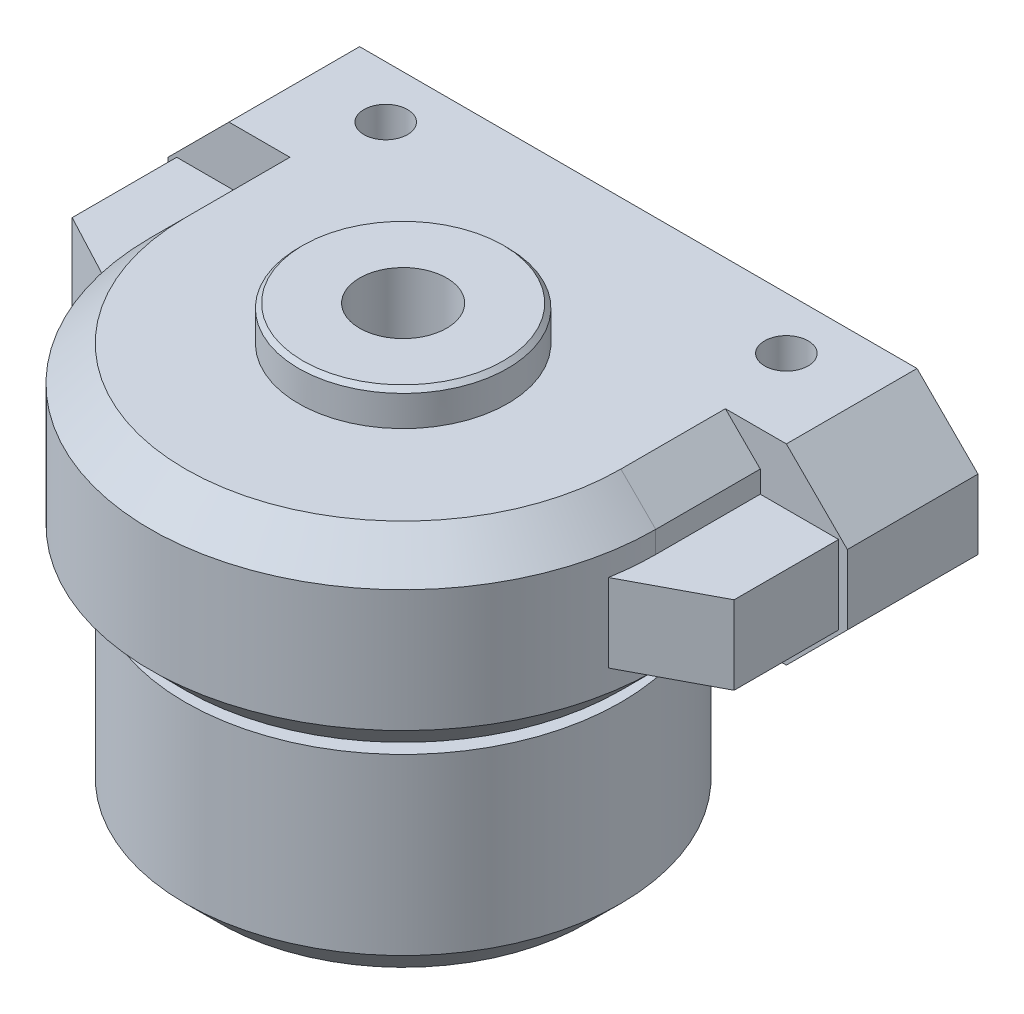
ISO-10303-21;
HEADER;
FILE_DESCRIPTION(('STEP AP214'),'2;1');
FILE_NAME('part.step','',(''),(''),'','','');
FILE_SCHEMA(('AUTOMOTIVE_DESIGN { 1 0 10303 214 1 1 1 1 }'));
ENDSEC;
DATA;
#1=APPLICATION_CONTEXT('core data for automotive mechanical design processes');
#2=APPLICATION_PROTOCOL_DEFINITION('international standard','automotive_design',2000,#1);
#3=PRODUCT_CONTEXT('',#1,'mechanical');
#4=PRODUCT('Part','Part','',(#3));
#5=PRODUCT_RELATED_PRODUCT_CATEGORY('part','',(#4));
#6=PRODUCT_DEFINITION_FORMATION('','',#4);
#7=PRODUCT_DEFINITION_CONTEXT('part definition',#1,'design');
#8=PRODUCT_DEFINITION('design','',#6,#7);
#9=PRODUCT_DEFINITION_SHAPE('','',#8);
#10=(LENGTH_UNIT() NAMED_UNIT(*) SI_UNIT(.MILLI.,.METRE.));
#11=(NAMED_UNIT(*) PLANE_ANGLE_UNIT() SI_UNIT($,.RADIAN.));
#12=(NAMED_UNIT(*) SI_UNIT($,.STERADIAN.) SOLID_ANGLE_UNIT());
#13=UNCERTAINTY_MEASURE_WITH_UNIT(LENGTH_MEASURE(1.E-05),#10,'distance_accuracy_value','');
#14=(GEOMETRIC_REPRESENTATION_CONTEXT(3) GLOBAL_UNCERTAINTY_ASSIGNED_CONTEXT((#13)) GLOBAL_UNIT_ASSIGNED_CONTEXT((#10,
#11,#12)) REPRESENTATION_CONTEXT('',''));
#15=CARTESIAN_POINT('',(0.,0.,0.));
#16=DIRECTION('',(0.,0.,1.));
#17=DIRECTION('',(1.,0.,0.));
#18=AXIS2_PLACEMENT_3D('',#15,#16,#17);
#19=CARTESIAN_POINT('',(0.,22.,15.));
#20=DIRECTION('',(0.,-1.,0.));
#21=DIRECTION('',(0.,0.,-1.));
#22=AXIS2_PLACEMENT_3D('',#19,#20,#21);
#23=PLANE('',#22);
#24=CARTESIAN_POINT('',(16.,22.,6.));
#25=DIRECTION('',(0.,1.,0.));
#26=DIRECTION('',(0.,0.,-1.));
#27=AXIS2_PLACEMENT_3D('',#24,#25,#26);
#28=CIRCLE('',#27,2.5);
#29=CARTESIAN_POINT('',(16.,22.,3.5));
#30=VERTEX_POINT('',#29);
#31=EDGE_CURVE('E346',#30,#30,#28,.T.);
#32=ORIENTED_EDGE('',*,*,#31,.F.);
#33=EDGE_LOOP('',(#32));
#34=FACE_BOUND('',#33,.T.);
#35=CARTESIAN_POINT('',(62.,22.,6.));
#36=DIRECTION('',(0.,1.,0.));
#37=DIRECTION('',(0.,0.,1.));
#38=AXIS2_PLACEMENT_3D('',#35,#36,#37);
#39=CIRCLE('',#38,2.5);
#40=CARTESIAN_POINT('',(62.,22.,8.5));
#41=VERTEX_POINT('',#40);
#42=EDGE_CURVE('E336',#41,#41,#39,.T.);
#43=ORIENTED_EDGE('',*,*,#42,.F.);
#44=EDGE_LOOP('',(#43));
#45=FACE_BOUND('',#44,.T.);
#46=DIRECTION('',(-1.,0.,0.));
#47=VECTOR('',#46,1.);
#48=CARTESIAN_POINT('',(0.,22.,15.));
#49=LINE('',#48,#47);
#50=CARTESIAN_POINT('',(71.,22.,15.));
#51=VERTEX_POINT('',#50);
#52=CARTESIAN_POINT('',(64.,22.,15.));
#53=VERTEX_POINT('',#52);
#54=EDGE_CURVE('E416',#51,#53,#49,.T.);
#55=ORIENTED_EDGE('',*,*,#54,.F.);
#56=DIRECTION('',(0.,0.,-1.));
#57=VECTOR('',#56,1.);
#58=CARTESIAN_POINT('',(71.,22.,15.));
#59=LINE('',#58,#57);
#60=CARTESIAN_POINT('',(71.,22.,0.));
#61=VERTEX_POINT('',#60);
#62=EDGE_CURVE('E513',#51,#61,#59,.T.);
#63=ORIENTED_EDGE('',*,*,#62,.T.);
#64=DIRECTION('',(-1.,0.,0.));
#65=VECTOR('',#64,1.);
#66=CARTESIAN_POINT('',(0.,22.,0.));
#67=LINE('',#66,#65);
#68=CARTESIAN_POINT('',(7.00000000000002,22.,0.));
#69=VERTEX_POINT('',#68);
#70=EDGE_CURVE('E547',#61,#69,#67,.T.);
#71=ORIENTED_EDGE('',*,*,#70,.T.);
#72=DIRECTION('',(0.,0.,1.));
#73=VECTOR('',#72,1.);
#74=CARTESIAN_POINT('',(7.00000000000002,22.,15.));
#75=LINE('',#74,#73);
#76=CARTESIAN_POINT('',(7.00000000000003,22.,15.));
#77=VERTEX_POINT('',#76);
#78=EDGE_CURVE('E511',#69,#77,#75,.T.);
#79=ORIENTED_EDGE('',*,*,#78,.T.);
#80=CARTESIAN_POINT('',(14.,22.,15.));
#81=VERTEX_POINT('',#80);
#82=EDGE_CURVE('E421',#81,#77,#49,.T.);
#83=ORIENTED_EDGE('',*,*,#82,.F.);
#84=DIRECTION('',(0.,0.,1.));
#85=VECTOR('',#84,1.);
#86=CARTESIAN_POINT('',(14.,22.,27.));
#87=LINE('',#86,#85);
#88=CARTESIAN_POINT('',(14.,22.,27.));
#89=VERTEX_POINT('',#88);
#90=EDGE_CURVE('E456',#81,#89,#87,.T.);
#91=ORIENTED_EDGE('',*,*,#90,.T.);
#92=CARTESIAN_POINT('',(39.,22.,27.));
#93=DIRECTION('',(0.,-1.,0.));
#94=DIRECTION('',(0.,0.,-1.));
#95=AXIS2_PLACEMENT_3D('',#92,#93,#94);
#96=CIRCLE('',#95,25.);
#97=CARTESIAN_POINT('',(64.,22.,27.));
#98=VERTEX_POINT('',#97);
#99=EDGE_CURVE('E460',#89,#98,#96,.F.);
#100=ORIENTED_EDGE('',*,*,#99,.T.);
#101=DIRECTION('',(0.,0.,-1.));
#102=VECTOR('',#101,1.);
#103=CARTESIAN_POINT('',(64.,22.,15.));
#104=LINE('',#103,#102);
#105=EDGE_CURVE('E462',#98,#53,#104,.T.);
#106=ORIENTED_EDGE('',*,*,#105,.T.);
#107=EDGE_LOOP('',(#55,#63,#71,#79,#83,#91,#100,#106));
#108=FACE_BOUND('',#107,.T.);
#109=CARTESIAN_POINT('',(39.,22.,27.));
#110=DIRECTION('',(0.,-1.,0.));
#111=DIRECTION('',(0.,0.,-1.));
#112=AXIS2_PLACEMENT_3D('',#109,#110,#111);
#113=CIRCLE('',#112,12.);
#114=CARTESIAN_POINT('',(39.,22.,15.));
#115=VERTEX_POINT('',#114);
#116=EDGE_CURVE('E328',#115,#115,#113,.F.);
#117=ORIENTED_EDGE('',*,*,#116,.F.);
#118=EDGE_LOOP('',(#117));
#119=FACE_BOUND('',#118,.T.);
#120=ADVANCED_FACE('F24',(#34,#45,#108,#119),#23,.F.);
#121=CARTESIAN_POINT('',(0.,22.,15.));
#122=DIRECTION('',(0.,0.,-1.));
#123=DIRECTION('',(-1.,0.,0.));
#124=AXIS2_PLACEMENT_3D('',#121,#122,#123);
#125=PLANE('',#124);
#126=DIRECTION('',(-1.,0.,0.));
#127=VECTOR('',#126,1.);
#128=CARTESIAN_POINT('',(1.,15.5,15.));
#129=LINE('',#128,#127);
#130=CARTESIAN_POINT('',(10.,15.5,15.));
#131=VERTEX_POINT('',#130);
#132=CARTESIAN_POINT('',(1.,15.5,15.));
#133=VERTEX_POINT('',#132);
#134=EDGE_CURVE('E238',#131,#133,#129,.T.);
#135=ORIENTED_EDGE('',*,*,#134,.F.);
#136=DIRECTION('',(0.,1.,0.));
#137=VECTOR('',#136,1.);
#138=CARTESIAN_POINT('',(10.,0.,15.));
#139=LINE('',#138,#137);
#140=CARTESIAN_POINT('',(10.,18.,15.));
#141=VERTEX_POINT('',#140);
#142=EDGE_CURVE('E322',#131,#141,#139,.T.);
#143=ORIENTED_EDGE('',*,*,#142,.T.);
#144=DIRECTION('',(0.707106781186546,0.707106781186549,0.));
#145=VECTOR('',#144,1.);
#146=CARTESIAN_POINT('',(7.00000000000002,15.,15.));
#147=LINE('',#146,#145);
#148=EDGE_CURVE('E473',#141,#81,#147,.T.);
#149=ORIENTED_EDGE('',*,*,#148,.T.);
#150=ORIENTED_EDGE('',*,*,#82,.T.);
#151=DIRECTION('',(0.707106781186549,0.707106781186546,0.));
#152=VECTOR('',#151,1.);
#153=CARTESIAN_POINT('',(0.,15.,15.));
#154=LINE('',#153,#152);
#155=CARTESIAN_POINT('',(0.,15.,15.));
#156=VERTEX_POINT('',#155);
#157=EDGE_CURVE('E521',#77,#156,#154,.F.);
#158=ORIENTED_EDGE('',*,*,#157,.T.);
#159=DIRECTION('',(0.,-1.,0.));
#160=VECTOR('',#159,1.);
#161=CARTESIAN_POINT('',(0.,0.,15.));
#162=LINE('',#161,#160);
#163=CARTESIAN_POINT('',(0.,7.00000000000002,15.));
#164=VERTEX_POINT('',#163);
#165=EDGE_CURVE('E499',#156,#164,#162,.T.);
#166=ORIENTED_EDGE('',*,*,#165,.T.);
#167=DIRECTION('',(-0.707106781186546,0.707106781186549,0.));
#168=VECTOR('',#167,1.);
#169=CARTESIAN_POINT('',(7.,0.,15.));
#170=LINE('',#169,#168);
#171=CARTESIAN_POINT('',(7.,0.,15.));
#172=VERTEX_POINT('',#171);
#173=EDGE_CURVE('E331',#164,#172,#170,.F.);
#174=ORIENTED_EDGE('',*,*,#173,.T.);
#175=DIRECTION('',(1.,0.,0.));
#176=VECTOR('',#175,1.);
#177=CARTESIAN_POINT('',(0.,0.,15.));
#178=LINE('',#177,#176);
#179=CARTESIAN_POINT('',(14.,0.,15.));
#180=VERTEX_POINT('',#179);
#181=EDGE_CURVE('E490',#172,#180,#178,.T.);
#182=ORIENTED_EDGE('',*,*,#181,.T.);
#183=DIRECTION('',(-0.707106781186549,0.707106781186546,0.));
#184=VECTOR('',#183,1.);
#185=CARTESIAN_POINT('',(-4.00000000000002,18.,15.));
#186=LINE('',#185,#184);
#187=CARTESIAN_POINT('',(10.,4.,15.));
#188=VERTEX_POINT('',#187);
#189=EDGE_CURVE('E468',#180,#188,#186,.T.);
#190=ORIENTED_EDGE('',*,*,#189,.T.);
#191=CARTESIAN_POINT('',(10.,6.5,15.));
#192=VERTEX_POINT('',#191);
#193=EDGE_CURVE('E318',#188,#192,#139,.T.);
#194=ORIENTED_EDGE('',*,*,#193,.T.);
#195=DIRECTION('',(-1.,0.,0.));
#196=VECTOR('',#195,1.);
#197=CARTESIAN_POINT('',(1.,6.5,15.));
#198=LINE('',#197,#196);
#199=CARTESIAN_POINT('',(1.,6.5,15.));
#200=VERTEX_POINT('',#199);
#201=EDGE_CURVE('E46',#192,#200,#198,.T.);
#202=ORIENTED_EDGE('',*,*,#201,.T.);
#203=DIRECTION('',(0.,-1.,0.));
#204=VECTOR('',#203,1.);
#205=CARTESIAN_POINT('',(1.,15.5,15.));
#206=LINE('',#205,#204);
#207=EDGE_CURVE('E41',#133,#200,#206,.T.);
#208=ORIENTED_EDGE('',*,*,#207,.F.);
#209=EDGE_LOOP('',(#135,#143,#149,#150,#158,#166,#174,#182,#190,#194,#202,#208));
#210=FACE_BOUND('',#209,.T.);
#211=ADVANCED_FACE('F374',(#210),#125,.F.);
#212=CARTESIAN_POINT('',(39.,0.,27.));
#213=DIRECTION('',(0.,1.,0.));
#214=DIRECTION('',(0.,0.,1.));
#215=AXIS2_PLACEMENT_3D('',#212,#213,#214);
#216=CYLINDRICAL_SURFACE('',#215,29.);
#217=DIRECTION('',(0.,1.,0.));
#218=VECTOR('',#217,1.);
#219=CARTESIAN_POINT('',(10.,0.,27.));
#220=LINE('',#219,#218);
#221=CARTESIAN_POINT('',(10.,15.5,27.));
#222=VERTEX_POINT('',#221);
#223=CARTESIAN_POINT('',(10.,18.,27.));
#224=VERTEX_POINT('',#223);
#225=EDGE_CURVE('E208',#222,#224,#220,.T.);
#226=ORIENTED_EDGE('',*,*,#225,.F.);
#227=CARTESIAN_POINT('',(39.,15.5,27.));
#228=DIRECTION('',(0.,-1.,0.));
#229=DIRECTION('',(0.,0.,-1.));
#230=AXIS2_PLACEMENT_3D('',#227,#228,#229);
#231=CIRCLE('',#230,29.);
#232=CARTESIAN_POINT('',(10.4342862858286,15.5,32.));
#233=VERTEX_POINT('',#232);
#234=EDGE_CURVE('E232',#233,#222,#231,.T.);
#235=ORIENTED_EDGE('',*,*,#234,.F.);
#236=DIRECTION('',(0.,-1.,0.));
#237=VECTOR('',#236,1.);
#238=CARTESIAN_POINT('',(10.4342862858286,15.5,32.));
#239=LINE('',#238,#237);
#240=CARTESIAN_POINT('',(10.4342862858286,6.5,32.));
#241=VERTEX_POINT('',#240);
#242=EDGE_CURVE('E215',#233,#241,#239,.T.);
#243=ORIENTED_EDGE('',*,*,#242,.T.);
#244=CARTESIAN_POINT('',(39.,6.5,27.));
#245=DIRECTION('',(0.,-1.,0.));
#246=DIRECTION('',(0.,0.,-1.));
#247=AXIS2_PLACEMENT_3D('',#244,#245,#246);
#248=CIRCLE('',#247,29.);
#249=CARTESIAN_POINT('',(10.,6.5,27.));
#250=VERTEX_POINT('',#249);
#251=EDGE_CURVE('E211',#241,#250,#248,.T.);
#252=ORIENTED_EDGE('',*,*,#251,.T.);
#253=CARTESIAN_POINT('',(10.,4.,27.));
#254=VERTEX_POINT('',#253);
#255=EDGE_CURVE('E197',#254,#250,#220,.T.);
#256=ORIENTED_EDGE('',*,*,#255,.F.);
#257=CARTESIAN_POINT('',(39.,4.,27.));
#258=DIRECTION('',(0.,1.,0.));
#259=DIRECTION('',(0.,0.,1.));
#260=AXIS2_PLACEMENT_3D('',#257,#258,#259);
#261=CIRCLE('',#260,29.);
#262=CARTESIAN_POINT('',(68.,4.,27.));
#263=VERTEX_POINT('',#262);
#264=EDGE_CURVE('E446',#254,#263,#261,.T.);
#265=ORIENTED_EDGE('',*,*,#264,.T.);
#266=DIRECTION('',(0.,1.,0.));
#267=VECTOR('',#266,1.);
#268=CARTESIAN_POINT('',(68.,0.,27.));
#269=LINE('',#268,#267);
#270=CARTESIAN_POINT('',(68.,6.5,27.));
#271=VERTEX_POINT('',#270);
#272=EDGE_CURVE('E553',#263,#271,#269,.T.);
#273=ORIENTED_EDGE('',*,*,#272,.T.);
#274=CARTESIAN_POINT('',(39.,6.5,27.));
#275=DIRECTION('',(0.,-1.,0.));
#276=DIRECTION('',(0.,0.,1.));
#277=AXIS2_PLACEMENT_3D('',#274,#275,#276);
#278=CIRCLE('',#277,29.);
#279=CARTESIAN_POINT('',(67.5657137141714,6.5,32.));
#280=VERTEX_POINT('',#279);
#281=EDGE_CURVE('E255',#271,#280,#278,.T.);
#282=ORIENTED_EDGE('',*,*,#281,.T.);
#283=DIRECTION('',(0.,-1.,0.));
#284=VECTOR('',#283,1.);
#285=CARTESIAN_POINT('',(67.5657137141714,15.5,32.));
#286=LINE('',#285,#284);
#287=CARTESIAN_POINT('',(67.5657137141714,15.5,32.));
#288=VERTEX_POINT('',#287);
#289=EDGE_CURVE('E279',#288,#280,#286,.T.);
#290=ORIENTED_EDGE('',*,*,#289,.F.);
#291=CARTESIAN_POINT('',(39.,15.5,27.));
#292=DIRECTION('',(0.,-1.,0.));
#293=DIRECTION('',(0.,0.,1.));
#294=AXIS2_PLACEMENT_3D('',#291,#292,#293);
#295=CIRCLE('',#294,29.);
#296=CARTESIAN_POINT('',(68.,15.5,27.));
#297=VERTEX_POINT('',#296);
#298=EDGE_CURVE('E268',#297,#288,#295,.T.);
#299=ORIENTED_EDGE('',*,*,#298,.F.);
#300=CARTESIAN_POINT('',(68.,18.,27.));
#301=VERTEX_POINT('',#300);
#302=EDGE_CURVE('E310',#297,#301,#269,.T.);
#303=ORIENTED_EDGE('',*,*,#302,.T.);
#304=CARTESIAN_POINT('',(39.,18.,27.));
#305=DIRECTION('',(0.,-1.,0.));
#306=DIRECTION('',(0.,0.,-1.));
#307=AXIS2_PLACEMENT_3D('',#304,#305,#306);
#308=CIRCLE('',#307,29.);
#309=EDGE_CURVE('E444',#301,#224,#308,.T.);
#310=ORIENTED_EDGE('',*,*,#309,.T.);
#311=EDGE_LOOP('',(#226,#235,#243,#252,#256,#265,#273,#282,#290,#299,#303,#310));
#312=FACE_BOUND('',#311,.T.);
#313=ADVANCED_FACE('F213',(#312),#216,.T.);
#314=CARTESIAN_POINT('',(10.,0.,15.));
#315=DIRECTION('',(-1.,0.,0.));
#316=DIRECTION('',(0.,0.,1.));
#317=AXIS2_PLACEMENT_3D('',#314,#315,#316);
#318=PLANE('',#317);
#319=ORIENTED_EDGE('',*,*,#142,.F.);
#320=DIRECTION('',(0.,0.,-1.));
#321=VECTOR('',#320,1.);
#322=CARTESIAN_POINT('',(9.99999999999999,15.5,15.));
#323=LINE('',#322,#321);
#324=EDGE_CURVE('E235',#222,#131,#323,.T.);
#325=ORIENTED_EDGE('',*,*,#324,.F.);
#326=ORIENTED_EDGE('',*,*,#225,.T.);
#327=DIRECTION('',(0.,0.,-1.));
#328=VECTOR('',#327,1.);
#329=CARTESIAN_POINT('',(10.,18.,15.));
#330=LINE('',#329,#328);
#331=EDGE_CURVE('E447',#224,#141,#330,.T.);
#332=ORIENTED_EDGE('',*,*,#331,.T.);
#333=EDGE_LOOP('',(#319,#325,#326,#332));
#334=FACE_BOUND('',#333,.T.);
#335=ADVANCED_FACE('F399',(#334),#318,.T.);
#336=CARTESIAN_POINT('',(68.,0.,15.));
#337=DIRECTION('',(1.,0.,0.));
#338=DIRECTION('',(0.,0.,-1.));
#339=AXIS2_PLACEMENT_3D('',#336,#337,#338);
#340=PLANE('',#339);
#341=DIRECTION('',(0.,1.,0.));
#342=VECTOR('',#341,1.);
#343=CARTESIAN_POINT('',(68.,0.,15.));
#344=LINE('',#343,#342);
#345=CARTESIAN_POINT('',(68.,4.,15.));
#346=VERTEX_POINT('',#345);
#347=CARTESIAN_POINT('',(68.,6.5,15.));
#348=VERTEX_POINT('',#347);
#349=EDGE_CURVE('E325',#346,#348,#344,.T.);
#350=ORIENTED_EDGE('',*,*,#349,.T.);
#351=DIRECTION('',(0.,0.,1.));
#352=VECTOR('',#351,1.);
#353=CARTESIAN_POINT('',(68.,6.5,15.));
#354=LINE('',#353,#352);
#355=EDGE_CURVE('E252',#348,#271,#354,.T.);
#356=ORIENTED_EDGE('',*,*,#355,.T.);
#357=ORIENTED_EDGE('',*,*,#272,.F.);
#358=DIRECTION('',(0.,0.,-1.));
#359=VECTOR('',#358,1.);
#360=CARTESIAN_POINT('',(68.,4.,15.));
#361=LINE('',#360,#359);
#362=EDGE_CURVE('E434',#263,#346,#361,.T.);
#363=ORIENTED_EDGE('',*,*,#362,.T.);
#364=EDGE_LOOP('',(#350,#356,#357,#363));
#365=FACE_BOUND('',#364,.T.);
#366=ADVANCED_FACE('F392',(#365),#340,.T.);
#367=CARTESIAN_POINT('',(0.,0.,15.));
#368=DIRECTION('',(0.,1.,0.));
#369=DIRECTION('',(0.,0.,1.));
#370=AXIS2_PLACEMENT_3D('',#367,#368,#369);
#371=PLANE('',#370);
#372=CARTESIAN_POINT('',(16.,0.,6.));
#373=DIRECTION('',(0.,1.,0.));
#374=DIRECTION('',(0.,0.,1.));
#375=AXIS2_PLACEMENT_3D('',#372,#373,#374);
#376=CIRCLE('',#375,2.5);
#377=CARTESIAN_POINT('',(16.,0.,8.5));
#378=VERTEX_POINT('',#377);
#379=EDGE_CURVE('E28',#378,#378,#376,.T.);
#380=ORIENTED_EDGE('',*,*,#379,.T.);
#381=EDGE_LOOP('',(#380));
#382=FACE_BOUND('',#381,.T.);
#383=CARTESIAN_POINT('',(62.,0.,6.));
#384=DIRECTION('',(0.,1.,0.));
#385=DIRECTION('',(0.,0.,1.));
#386=AXIS2_PLACEMENT_3D('',#383,#384,#385);
#387=CIRCLE('',#386,2.5);
#388=CARTESIAN_POINT('',(62.,0.,8.5));
#389=VERTEX_POINT('',#388);
#390=EDGE_CURVE('E333',#389,#389,#387,.T.);
#391=ORIENTED_EDGE('',*,*,#390,.T.);
#392=EDGE_LOOP('',(#391));
#393=FACE_BOUND('',#392,.T.);
#394=DIRECTION('',(1.,0.,0.));
#395=VECTOR('',#394,1.);
#396=CARTESIAN_POINT('',(0.,0.,0.));
#397=LINE('',#396,#395);
#398=CARTESIAN_POINT('',(7.,0.,0.));
#399=VERTEX_POINT('',#398);
#400=CARTESIAN_POINT('',(71.,0.,0.));
#401=VERTEX_POINT('',#400);
#402=EDGE_CURVE('E409',#399,#401,#397,.T.);
#403=ORIENTED_EDGE('',*,*,#402,.T.);
#404=DIRECTION('',(0.,0.,1.));
#405=VECTOR('',#404,1.);
#406=CARTESIAN_POINT('',(71.,0.,15.));
#407=LINE('',#406,#405);
#408=CARTESIAN_POINT('',(71.,0.,15.));
#409=VERTEX_POINT('',#408);
#410=EDGE_CURVE('E506',#401,#409,#407,.T.);
#411=ORIENTED_EDGE('',*,*,#410,.T.);
#412=CARTESIAN_POINT('',(64.,0.,15.));
#413=VERTEX_POINT('',#412);
#414=EDGE_CURVE('E494',#413,#409,#178,.T.);
#415=ORIENTED_EDGE('',*,*,#414,.F.);
#416=DIRECTION('',(0.,0.,1.));
#417=VECTOR('',#416,1.);
#418=CARTESIAN_POINT('',(64.,0.,27.));
#419=LINE('',#418,#417);
#420=CARTESIAN_POINT('',(64.,0.,27.));
#421=VERTEX_POINT('',#420);
#422=EDGE_CURVE('E442',#413,#421,#419,.T.);
#423=ORIENTED_EDGE('',*,*,#422,.T.);
#424=CARTESIAN_POINT('',(39.,0.,27.));
#425=DIRECTION('',(0.,1.,0.));
#426=DIRECTION('',(0.,0.,1.));
#427=AXIS2_PLACEMENT_3D('',#424,#425,#426);
#428=CIRCLE('',#427,25.);
#429=CARTESIAN_POINT('',(14.,0.,27.));
#430=VERTEX_POINT('',#429);
#431=EDGE_CURVE('E440',#421,#430,#428,.F.);
#432=ORIENTED_EDGE('',*,*,#431,.T.);
#433=DIRECTION('',(0.,0.,-1.));
#434=VECTOR('',#433,1.);
#435=CARTESIAN_POINT('',(14.,0.,15.));
#436=LINE('',#435,#434);
#437=EDGE_CURVE('E437',#430,#180,#436,.T.);
#438=ORIENTED_EDGE('',*,*,#437,.T.);
#439=ORIENTED_EDGE('',*,*,#181,.F.);
#440=DIRECTION('',(0.,0.,-1.));
#441=VECTOR('',#440,1.);
#442=CARTESIAN_POINT('',(7.,0.,15.));
#443=LINE('',#442,#441);
#444=EDGE_CURVE('E489',#172,#399,#443,.T.);
#445=ORIENTED_EDGE('',*,*,#444,.T.);
#446=EDGE_LOOP('',(#403,#411,#415,#423,#432,#438,#439,#445));
#447=FACE_BOUND('',#446,.T.);
#448=CARTESIAN_POINT('',(39.,0.,27.));
#449=DIRECTION('',(0.,1.,0.));
#450=DIRECTION('',(0.,0.,1.));
#451=AXIS2_PLACEMENT_3D('',#448,#449,#450);
#452=CIRCLE('',#451,12.5);
#453=CARTESIAN_POINT('',(39.,0.,39.5));
#454=VERTEX_POINT('',#453);
#455=EDGE_CURVE('E413',#454,#454,#452,.F.);
#456=ORIENTED_EDGE('',*,*,#455,.F.);
#457=EDGE_LOOP('',(#456));
#458=FACE_BOUND('',#457,.T.);
#459=ADVANCED_FACE('F390',(#382,#393,#447,#458),#371,.F.);
#460=CARTESIAN_POINT('',(68.,15.5,15.));
#461=VERTEX_POINT('',#460);
#462=CARTESIAN_POINT('',(68.,18.,15.));
#463=VERTEX_POINT('',#462);
#464=EDGE_CURVE('E326',#461,#463,#344,.T.);
#465=ORIENTED_EDGE('',*,*,#464,.F.);
#466=DIRECTION('',(-1.,0.,0.));
#467=VECTOR('',#466,1.);
#468=CARTESIAN_POINT('',(77.,15.5,15.));
#469=LINE('',#468,#467);
#470=CARTESIAN_POINT('',(77.,15.5,15.));
#471=VERTEX_POINT('',#470);
#472=EDGE_CURVE('E264',#471,#461,#469,.T.);
#473=ORIENTED_EDGE('',*,*,#472,.F.);
#474=DIRECTION('',(0.,-1.,0.));
#475=VECTOR('',#474,1.);
#476=CARTESIAN_POINT('',(77.,15.5,15.));
#477=LINE('',#476,#475);
#478=CARTESIAN_POINT('',(77.,6.5,15.));
#479=VERTEX_POINT('',#478);
#480=EDGE_CURVE('E274',#471,#479,#477,.T.);
#481=ORIENTED_EDGE('',*,*,#480,.T.);
#482=DIRECTION('',(-1.,0.,0.));
#483=VECTOR('',#482,1.);
#484=CARTESIAN_POINT('',(77.,6.5,15.));
#485=LINE('',#484,#483);
#486=EDGE_CURVE('E249',#479,#348,#485,.T.);
#487=ORIENTED_EDGE('',*,*,#486,.T.);
#488=ORIENTED_EDGE('',*,*,#349,.F.);
#489=DIRECTION('',(-0.707106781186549,-0.707106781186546,0.));
#490=VECTOR('',#489,1.);
#491=CARTESIAN_POINT('',(42.9999999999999,-21.,15.));
#492=LINE('',#491,#490);
#493=EDGE_CURVE('E465',#346,#413,#492,.T.);
#494=ORIENTED_EDGE('',*,*,#493,.T.);
#495=ORIENTED_EDGE('',*,*,#414,.T.);
#496=DIRECTION('',(-0.707106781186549,-0.707106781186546,0.));
#497=VECTOR('',#496,1.);
#498=CARTESIAN_POINT('',(78.,7.00000000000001,15.));
#499=LINE('',#498,#497);
#500=CARTESIAN_POINT('',(78.,7.00000000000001,15.));
#501=VERTEX_POINT('',#500);
#502=EDGE_CURVE('E509',#409,#501,#499,.F.);
#503=ORIENTED_EDGE('',*,*,#502,.T.);
#504=DIRECTION('',(0.,1.,0.));
#505=VECTOR('',#504,1.);
#506=CARTESIAN_POINT('',(78.,0.,15.));
#507=LINE('',#506,#505);
#508=CARTESIAN_POINT('',(78.,15.,15.));
#509=VERTEX_POINT('',#508);
#510=EDGE_CURVE('E493',#501,#509,#507,.T.);
#511=ORIENTED_EDGE('',*,*,#510,.T.);
#512=DIRECTION('',(0.707106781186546,-0.707106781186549,0.));
#513=VECTOR('',#512,1.);
#514=CARTESIAN_POINT('',(71.,22.,15.));
#515=LINE('',#514,#513);
#516=EDGE_CURVE('E507',#509,#51,#515,.F.);
#517=ORIENTED_EDGE('',*,*,#516,.T.);
#518=ORIENTED_EDGE('',*,*,#54,.T.);
#519=DIRECTION('',(0.707106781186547,-0.707106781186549,0.));
#520=VECTOR('',#519,1.);
#521=CARTESIAN_POINT('',(32.0000000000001,54.,15.));
#522=LINE('',#521,#520);
#523=EDGE_CURVE('E470',#53,#463,#522,.T.);
#524=ORIENTED_EDGE('',*,*,#523,.T.);
#525=EDGE_LOOP('',(#465,#473,#481,#487,#488,#494,#495,#503,#511,#517,#518,#524));
#526=FACE_BOUND('',#525,.T.);
#527=ADVANCED_FACE('F381',(#526),#125,.F.);
#528=CARTESIAN_POINT('',(0.,0.,15.));
#529=DIRECTION('',(1.,0.,0.));
#530=DIRECTION('',(0.,0.,-1.));
#531=AXIS2_PLACEMENT_3D('',#528,#529,#530);
#532=PLANE('',#531);
#533=DIRECTION('',(0.,-1.,0.));
#534=VECTOR('',#533,1.);
#535=CARTESIAN_POINT('',(0.,0.,0.));
#536=LINE('',#535,#534);
#537=CARTESIAN_POINT('',(0.,15.,0.));
#538=VERTEX_POINT('',#537);
#539=CARTESIAN_POINT('',(0.,7.00000000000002,0.));
#540=VERTEX_POINT('',#539);
#541=EDGE_CURVE('E207',#538,#540,#536,.T.);
#542=ORIENTED_EDGE('',*,*,#541,.T.);
#543=DIRECTION('',(0.,0.,1.));
#544=VECTOR('',#543,1.);
#545=CARTESIAN_POINT('',(0.,7.00000000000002,15.));
#546=LINE('',#545,#544);
#547=EDGE_CURVE('E519',#540,#164,#546,.T.);
#548=ORIENTED_EDGE('',*,*,#547,.T.);
#549=ORIENTED_EDGE('',*,*,#165,.F.);
#550=DIRECTION('',(0.,0.,-1.));
#551=VECTOR('',#550,1.);
#552=CARTESIAN_POINT('',(0.,15.,15.));
#553=LINE('',#552,#551);
#554=EDGE_CURVE('E516',#156,#538,#553,.T.);
#555=ORIENTED_EDGE('',*,*,#554,.T.);
#556=EDGE_LOOP('',(#542,#548,#549,#555));
#557=FACE_BOUND('',#556,.T.);
#558=ADVANCED_FACE('F26',(#557),#532,.F.);
#559=CARTESIAN_POINT('',(78.,0.,15.));
#560=DIRECTION('',(-1.,0.,0.));
#561=DIRECTION('',(0.,0.,1.));
#562=AXIS2_PLACEMENT_3D('',#559,#560,#561);
#563=PLANE('',#562);
#564=ORIENTED_EDGE('',*,*,#510,.F.);
#565=DIRECTION('',(0.,0.,-1.));
#566=VECTOR('',#565,1.);
#567=CARTESIAN_POINT('',(78.,7.00000000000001,15.));
#568=LINE('',#567,#566);
#569=CARTESIAN_POINT('',(78.,7.00000000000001,0.));
#570=VERTEX_POINT('',#569);
#571=EDGE_CURVE('E478',#501,#570,#568,.T.);
#572=ORIENTED_EDGE('',*,*,#571,.T.);
#573=DIRECTION('',(0.,1.,0.));
#574=VECTOR('',#573,1.);
#575=CARTESIAN_POINT('',(78.,0.,0.));
#576=LINE('',#575,#574);
#577=CARTESIAN_POINT('',(78.,15.,0.));
#578=VERTEX_POINT('',#577);
#579=EDGE_CURVE('E543',#570,#578,#576,.T.);
#580=ORIENTED_EDGE('',*,*,#579,.T.);
#581=DIRECTION('',(0.,0.,1.));
#582=VECTOR('',#581,1.);
#583=CARTESIAN_POINT('',(78.,15.,15.));
#584=LINE('',#583,#582);
#585=EDGE_CURVE('E476',#578,#509,#584,.T.);
#586=ORIENTED_EDGE('',*,*,#585,.T.);
#587=EDGE_LOOP('',(#564,#572,#580,#586));
#588=FACE_BOUND('',#587,.T.);
#589=ADVANCED_FACE('F386',(#588),#563,.F.);
#590=CARTESIAN_POINT('',(0.,22.,0.));
#591=DIRECTION('',(0.,0.,-1.));
#592=DIRECTION('',(-1.,0.,0.));
#593=AXIS2_PLACEMENT_3D('',#590,#591,#592);
#594=PLANE('',#593);
#595=CARTESIAN_POINT('',(71.5,11.,0.));
#596=DIRECTION('',(0.,0.,-1.));
#597=DIRECTION('',(1.,0.,0.));
#598=AXIS2_PLACEMENT_3D('',#595,#596,#597);
#599=CIRCLE('',#598,2.50000000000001);
#600=CARTESIAN_POINT('',(74.,11.,0.));
#601=VERTEX_POINT('',#600);
#602=EDGE_CURVE('E281',#601,#601,#599,.T.);
#603=ORIENTED_EDGE('',*,*,#602,.F.);
#604=EDGE_LOOP('',(#603));
#605=FACE_BOUND('',#604,.T.);
#606=CARTESIAN_POINT('',(6.49999999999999,11.,0.));
#607=DIRECTION('',(0.,0.,-1.));
#608=DIRECTION('',(-1.,0.,0.));
#609=AXIS2_PLACEMENT_3D('',#606,#607,#608);
#610=CIRCLE('',#609,2.5);
#611=CARTESIAN_POINT('',(3.99999999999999,11.,0.));
#612=VERTEX_POINT('',#611);
#613=EDGE_CURVE('E287',#612,#612,#610,.T.);
#614=ORIENTED_EDGE('',*,*,#613,.F.);
#615=EDGE_LOOP('',(#614));
#616=FACE_BOUND('',#615,.T.);
#617=ORIENTED_EDGE('',*,*,#579,.F.);
#618=DIRECTION('',(0.707106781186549,0.707106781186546,0.));
#619=VECTOR('',#618,1.);
#620=CARTESIAN_POINT('',(46.4999999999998,-24.5,0.));
#621=LINE('',#620,#619);
#622=EDGE_CURVE('E487',#570,#401,#621,.F.);
#623=ORIENTED_EDGE('',*,*,#622,.T.);
#624=ORIENTED_EDGE('',*,*,#402,.F.);
#625=DIRECTION('',(0.707106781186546,-0.707106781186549,0.));
#626=VECTOR('',#625,1.);
#627=CARTESIAN_POINT('',(-7.49999999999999,14.5,0.));
#628=LINE('',#627,#626);
#629=EDGE_CURVE('E483',#399,#540,#628,.F.);
#630=ORIENTED_EDGE('',*,*,#629,.T.);
#631=ORIENTED_EDGE('',*,*,#541,.F.);
#632=DIRECTION('',(-0.707106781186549,-0.707106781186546,0.));
#633=VECTOR('',#632,1.);
#634=CARTESIAN_POINT('',(3.5,18.5,0.));
#635=LINE('',#634,#633);
#636=EDGE_CURVE('E481',#538,#69,#635,.F.);
#637=ORIENTED_EDGE('',*,*,#636,.T.);
#638=ORIENTED_EDGE('',*,*,#70,.F.);
#639=DIRECTION('',(-0.707106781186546,0.707106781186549,0.));
#640=VECTOR('',#639,1.);
#641=CARTESIAN_POINT('',(35.5000000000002,57.5,0.));
#642=LINE('',#641,#640);
#643=EDGE_CURVE('E485',#61,#578,#642,.F.);
#644=ORIENTED_EDGE('',*,*,#643,.T.);
#645=EDGE_LOOP('',(#617,#623,#624,#630,#631,#637,#638,#644));
#646=FACE_BOUND('',#645,.T.);
#647=ADVANCED_FACE('F388',(#605,#616,#646),#594,.T.);
#648=DIRECTION('',(0.,0.,-1.));
#649=VECTOR('',#648,1.);
#650=CARTESIAN_POINT('',(9.99999999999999,6.5,15.));
#651=LINE('',#650,#649);
#652=EDGE_CURVE('E202',#250,#192,#651,.T.);
#653=ORIENTED_EDGE('',*,*,#652,.T.);
#654=ORIENTED_EDGE('',*,*,#193,.F.);
#655=DIRECTION('',(0.,0.,1.));
#656=VECTOR('',#655,1.);
#657=CARTESIAN_POINT('',(10.,4.,27.));
#658=LINE('',#657,#656);
#659=EDGE_CURVE('E204',#188,#254,#658,.T.);
#660=ORIENTED_EDGE('',*,*,#659,.T.);
#661=ORIENTED_EDGE('',*,*,#255,.T.);
#662=EDGE_LOOP('',(#653,#654,#660,#661));
#663=FACE_BOUND('',#662,.T.);
#664=ADVANCED_FACE('F199',(#663),#318,.T.);
#665=DIRECTION('',(0.,0.,1.));
#666=VECTOR('',#665,1.);
#667=CARTESIAN_POINT('',(68.,15.5,15.));
#668=LINE('',#667,#666);
#669=EDGE_CURVE('E266',#461,#297,#668,.T.);
#670=ORIENTED_EDGE('',*,*,#669,.F.);
#671=ORIENTED_EDGE('',*,*,#464,.T.);
#672=DIRECTION('',(0.,0.,1.));
#673=VECTOR('',#672,1.);
#674=CARTESIAN_POINT('',(68.,18.,27.));
#675=LINE('',#674,#673);
#676=EDGE_CURVE('E429',#463,#301,#675,.T.);
#677=ORIENTED_EDGE('',*,*,#676,.T.);
#678=ORIENTED_EDGE('',*,*,#302,.F.);
#679=EDGE_LOOP('',(#670,#671,#677,#678));
#680=FACE_BOUND('',#679,.T.);
#681=ADVANCED_FACE('F402',(#680),#340,.T.);
#682=CARTESIAN_POINT('',(39.,-1.2,27.));
#683=DIRECTION('',(0.,1.,0.));
#684=DIRECTION('',(0.,0.,1.));
#685=AXIS2_PLACEMENT_3D('',#682,#683,#684);
#686=CYLINDRICAL_SURFACE('',#685,12.5);
#687=CARTESIAN_POINT('',(39.,-1.2,27.));
#688=DIRECTION('',(0.,-1.,0.));
#689=DIRECTION('',(0.,0.,-1.));
#690=AXIS2_PLACEMENT_3D('',#687,#688,#689);
#691=CIRCLE('',#690,12.5);
#692=CARTESIAN_POINT('',(39.,-1.2,14.5));
#693=VERTEX_POINT('',#692);
#694=EDGE_CURVE('E308',#693,#693,#691,.T.);
#695=ORIENTED_EDGE('',*,*,#694,.F.);
#696=EDGE_LOOP('',(#695));
#697=FACE_BOUND('',#696,.T.);
#698=ORIENTED_EDGE('',*,*,#455,.T.);
#699=EDGE_LOOP('',(#698));
#700=FACE_BOUND('',#699,.T.);
#701=ADVANCED_FACE('F649',(#697,#700),#686,.T.);
#702=CARTESIAN_POINT('',(39.,-1.2,27.));
#703=DIRECTION('',(0.,-1.,0.));
#704=DIRECTION('',(0.,0.,-1.));
#705=AXIS2_PLACEMENT_3D('',#702,#703,#704);
#706=PLANE('',#705);
#707=CARTESIAN_POINT('',(39.,-1.2,27.));
#708=DIRECTION('',(0.,-1.,0.));
#709=DIRECTION('',(0.,0.,-1.));
#710=AXIS2_PLACEMENT_3D('',#707,#708,#709);
#711=CIRCLE('',#710,25.);
#712=CARTESIAN_POINT('',(39.,-1.2,2.));
#713=VERTEX_POINT('',#712);
#714=EDGE_CURVE('E305',#713,#713,#711,.T.);
#715=ORIENTED_EDGE('',*,*,#714,.F.);
#716=EDGE_LOOP('',(#715));
#717=FACE_BOUND('',#716,.T.);
#718=ORIENTED_EDGE('',*,*,#694,.T.);
#719=EDGE_LOOP('',(#718));
#720=FACE_BOUND('',#719,.T.);
#721=ADVANCED_FACE('F654',(#717,#720),#706,.F.);
#722=CARTESIAN_POINT('',(39.,-25.2,27.));
#723=DIRECTION('',(0.,1.,0.));
#724=DIRECTION('',(0.,0.,1.));
#725=AXIS2_PLACEMENT_3D('',#722,#723,#724);
#726=CYLINDRICAL_SURFACE('',#725,25.);
#727=CARTESIAN_POINT('',(39.,-21.2,27.));
#728=DIRECTION('',(0.,-1.,0.));
#729=DIRECTION('',(0.,0.,-1.));
#730=AXIS2_PLACEMENT_3D('',#727,#728,#729);
#731=CIRCLE('',#730,25.);
#732=CARTESIAN_POINT('',(39.,-21.2,2.));
#733=VERTEX_POINT('',#732);
#734=EDGE_CURVE('E419',#733,#733,#731,.F.);
#735=ORIENTED_EDGE('',*,*,#734,.T.);
#736=EDGE_LOOP('',(#735));
#737=FACE_BOUND('',#736,.T.);
#738=ORIENTED_EDGE('',*,*,#714,.T.);
#739=EDGE_LOOP('',(#738));
#740=FACE_BOUND('',#739,.T.);
#741=ADVANCED_FACE('F663',(#737,#740),#726,.T.);
#742=CARTESIAN_POINT('',(39.,-25.2,27.));
#743=DIRECTION('',(0.,-1.,0.));
#744=DIRECTION('',(0.,0.,-1.));
#745=AXIS2_PLACEMENT_3D('',#742,#743,#744);
#746=PLANE('',#745);
#747=CARTESIAN_POINT('',(39.,-25.2,27.));
#748=DIRECTION('',(0.,-1.,0.));
#749=DIRECTION('',(0.,0.,-1.));
#750=AXIS2_PLACEMENT_3D('',#747,#748,#749);
#751=CIRCLE('',#750,21.);
#752=CARTESIAN_POINT('',(39.,-25.2,6.00000000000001));
#753=VERTEX_POINT('',#752);
#754=EDGE_CURVE('E415',#753,#753,#751,.T.);
#755=ORIENTED_EDGE('',*,*,#754,.T.);
#756=EDGE_LOOP('',(#755));
#757=FACE_BOUND('',#756,.T.);
#758=ADVANCED_FACE('F672',(#757),#746,.T.);
#759=CARTESIAN_POINT('',(39.,-25.2,27.));
#760=DIRECTION('',(0.,1.,0.));
#761=DIRECTION('',(0.,0.,1.));
#762=AXIS2_PLACEMENT_3D('',#759,#760,#761);
#763=CONICAL_SURFACE('',#762,21.,0.785398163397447);
#764=ORIENTED_EDGE('',*,*,#734,.F.);
#765=EDGE_LOOP('',(#764));
#766=FACE_BOUND('',#765,.T.);
#767=ORIENTED_EDGE('',*,*,#754,.F.);
#768=EDGE_LOOP('',(#767));
#769=FACE_BOUND('',#768,.T.);
#770=ADVANCED_FACE('F679',(#766,#769),#763,.T.);
#771=CARTESIAN_POINT('',(10.,4.,15.));
#772=DIRECTION('',(-0.707106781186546,-0.707106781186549,0.));
#773=DIRECTION('',(0.707106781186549,-0.707106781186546,0.));
#774=AXIS2_PLACEMENT_3D('',#771,#772,#773);
#775=PLANE('',#774);
#776=ORIENTED_EDGE('',*,*,#189,.F.);
#777=ORIENTED_EDGE('',*,*,#437,.F.);
#778=DIRECTION('',(0.707106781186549,-0.707106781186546,0.));
#779=VECTOR('',#778,1.);
#780=CARTESIAN_POINT('',(10.,4.,27.));
#781=LINE('',#780,#779);
#782=EDGE_CURVE('E302',#254,#430,#781,.T.);
#783=ORIENTED_EDGE('',*,*,#782,.F.);
#784=ORIENTED_EDGE('',*,*,#659,.F.);
#785=EDGE_LOOP('',(#776,#777,#783,#784));
#786=FACE_BOUND('',#785,.T.);
#787=ADVANCED_FACE('F584',(#786),#775,.T.);
#788=CARTESIAN_POINT('',(39.,4.,27.));
#789=DIRECTION('',(0.,1.,0.));
#790=DIRECTION('',(0.,0.,1.));
#791=AXIS2_PLACEMENT_3D('',#788,#789,#790);
#792=CONICAL_SURFACE('',#791,29.,0.78539816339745);
#793=ORIENTED_EDGE('',*,*,#782,.T.);
#794=ORIENTED_EDGE('',*,*,#431,.F.);
#795=DIRECTION('',(-0.707106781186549,-0.707106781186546,0.));
#796=VECTOR('',#795,1.);
#797=CARTESIAN_POINT('',(68.,4.,27.));
#798=LINE('',#797,#796);
#799=EDGE_CURVE('E299',#263,#421,#798,.T.);
#800=ORIENTED_EDGE('',*,*,#799,.F.);
#801=ORIENTED_EDGE('',*,*,#264,.F.);
#802=EDGE_LOOP('',(#793,#794,#800,#801));
#803=FACE_BOUND('',#802,.T.);
#804=ADVANCED_FACE('F588',(#803),#792,.T.);
#805=CARTESIAN_POINT('',(68.,4.,15.));
#806=DIRECTION('',(0.707106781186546,-0.707106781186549,0.));
#807=DIRECTION('',(0.707106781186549,0.707106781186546,0.));
#808=AXIS2_PLACEMENT_3D('',#805,#806,#807);
#809=PLANE('',#808);
#810=ORIENTED_EDGE('',*,*,#799,.T.);
#811=ORIENTED_EDGE('',*,*,#422,.F.);
#812=ORIENTED_EDGE('',*,*,#493,.F.);
#813=ORIENTED_EDGE('',*,*,#362,.F.);
#814=EDGE_LOOP('',(#810,#811,#812,#813));
#815=FACE_BOUND('',#814,.T.);
#816=ADVANCED_FACE('F591',(#815),#809,.T.);
#817=CARTESIAN_POINT('',(14.,22.,15.));
#818=DIRECTION('',(-0.707106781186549,0.707106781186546,0.));
#819=DIRECTION('',(-0.707106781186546,-0.707106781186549,0.));
#820=AXIS2_PLACEMENT_3D('',#817,#818,#819);
#821=PLANE('',#820);
#822=ORIENTED_EDGE('',*,*,#148,.F.);
#823=ORIENTED_EDGE('',*,*,#331,.F.);
#824=DIRECTION('',(-0.707106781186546,-0.707106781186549,0.));
#825=VECTOR('',#824,1.);
#826=CARTESIAN_POINT('',(14.,22.,27.));
#827=LINE('',#826,#825);
#828=EDGE_CURVE('E296',#89,#224,#827,.T.);
#829=ORIENTED_EDGE('',*,*,#828,.F.);
#830=ORIENTED_EDGE('',*,*,#90,.F.);
#831=EDGE_LOOP('',(#822,#823,#829,#830));
#832=FACE_BOUND('',#831,.T.);
#833=ADVANCED_FACE('F577',(#832),#821,.T.);
#834=CARTESIAN_POINT('',(39.,22.,27.));
#835=DIRECTION('',(0.,-1.,0.));
#836=DIRECTION('',(0.,0.,-1.));
#837=AXIS2_PLACEMENT_3D('',#834,#835,#836);
#838=CONICAL_SURFACE('',#837,25.,0.785398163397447);
#839=ORIENTED_EDGE('',*,*,#828,.T.);
#840=ORIENTED_EDGE('',*,*,#309,.F.);
#841=DIRECTION('',(0.707106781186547,-0.707106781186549,0.));
#842=VECTOR('',#841,1.);
#843=CARTESIAN_POINT('',(64.,22.,27.));
#844=LINE('',#843,#842);
#845=EDGE_CURVE('E293',#98,#301,#844,.T.);
#846=ORIENTED_EDGE('',*,*,#845,.F.);
#847=ORIENTED_EDGE('',*,*,#99,.F.);
#848=EDGE_LOOP('',(#839,#840,#846,#847));
#849=FACE_BOUND('',#848,.T.);
#850=ADVANCED_FACE('F565',(#849),#838,.T.);
#851=CARTESIAN_POINT('',(64.,22.,15.));
#852=DIRECTION('',(0.707106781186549,0.707106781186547,0.));
#853=DIRECTION('',(-0.707106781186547,0.707106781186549,0.));
#854=AXIS2_PLACEMENT_3D('',#851,#852,#853);
#855=PLANE('',#854);
#856=ORIENTED_EDGE('',*,*,#845,.T.);
#857=ORIENTED_EDGE('',*,*,#676,.F.);
#858=ORIENTED_EDGE('',*,*,#523,.F.);
#859=ORIENTED_EDGE('',*,*,#105,.F.);
#860=EDGE_LOOP('',(#856,#857,#858,#859));
#861=FACE_BOUND('',#860,.T.);
#862=ADVANCED_FACE('F569',(#861),#855,.T.);
#863=CARTESIAN_POINT('',(78.,7.00000000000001,15.));
#864=DIRECTION('',(-0.707106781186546,0.707106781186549,0.));
#865=DIRECTION('',(-0.707106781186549,-0.707106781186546,0.));
#866=AXIS2_PLACEMENT_3D('',#863,#864,#865);
#867=PLANE('',#866);
#868=ORIENTED_EDGE('',*,*,#502,.F.);
#869=ORIENTED_EDGE('',*,*,#410,.F.);
#870=ORIENTED_EDGE('',*,*,#622,.F.);
#871=ORIENTED_EDGE('',*,*,#571,.F.);
#872=EDGE_LOOP('',(#868,#869,#870,#871));
#873=FACE_BOUND('',#872,.T.);
#874=ADVANCED_FACE('F540',(#873),#867,.F.);
#875=CARTESIAN_POINT('',(71.,22.,15.));
#876=DIRECTION('',(-0.707106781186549,-0.707106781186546,0.));
#877=DIRECTION('',(0.707106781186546,-0.707106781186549,0.));
#878=AXIS2_PLACEMENT_3D('',#875,#876,#877);
#879=PLANE('',#878);
#880=ORIENTED_EDGE('',*,*,#516,.F.);
#881=ORIENTED_EDGE('',*,*,#585,.F.);
#882=ORIENTED_EDGE('',*,*,#643,.F.);
#883=ORIENTED_EDGE('',*,*,#62,.F.);
#884=EDGE_LOOP('',(#880,#881,#882,#883));
#885=FACE_BOUND('',#884,.T.);
#886=ADVANCED_FACE('F609',(#885),#879,.F.);
#887=CARTESIAN_POINT('',(7.,0.,15.));
#888=DIRECTION('',(0.707106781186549,0.707106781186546,0.));
#889=DIRECTION('',(-0.707106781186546,0.707106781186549,0.));
#890=AXIS2_PLACEMENT_3D('',#887,#888,#889);
#891=PLANE('',#890);
#892=ORIENTED_EDGE('',*,*,#173,.F.);
#893=ORIENTED_EDGE('',*,*,#547,.F.);
#894=ORIENTED_EDGE('',*,*,#629,.F.);
#895=ORIENTED_EDGE('',*,*,#444,.F.);
#896=EDGE_LOOP('',(#892,#893,#894,#895));
#897=FACE_BOUND('',#896,.T.);
#898=ADVANCED_FACE('F531',(#897),#891,.F.);
#899=CARTESIAN_POINT('',(0.,15.,15.));
#900=DIRECTION('',(0.707106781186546,-0.707106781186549,0.));
#901=DIRECTION('',(0.707106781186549,0.707106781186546,0.));
#902=AXIS2_PLACEMENT_3D('',#899,#900,#901);
#903=PLANE('',#902);
#904=ORIENTED_EDGE('',*,*,#157,.F.);
#905=ORIENTED_EDGE('',*,*,#78,.F.);
#906=ORIENTED_EDGE('',*,*,#636,.F.);
#907=ORIENTED_EDGE('',*,*,#554,.F.);
#908=EDGE_LOOP('',(#904,#905,#906,#907));
#909=FACE_BOUND('',#908,.T.);
#910=ADVANCED_FACE('F614',(#909),#903,.F.);
#911=CARTESIAN_POINT('',(6.49999999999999,11.,56.));
#912=DIRECTION('',(0.,0.,-1.));
#913=DIRECTION('',(-1.,0.,0.));
#914=AXIS2_PLACEMENT_3D('',#911,#912,#913);
#915=CYLINDRICAL_SURFACE('',#914,2.5);
#916=ORIENTED_EDGE('',*,*,#613,.T.);
#917=EDGE_LOOP('',(#916));
#918=FACE_BOUND('',#917,.T.);
#919=CARTESIAN_POINT('',(6.49999999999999,11.,15.));
#920=DIRECTION('',(0.,0.,-1.));
#921=DIRECTION('',(-1.,0.,0.));
#922=AXIS2_PLACEMENT_3D('',#919,#920,#921);
#923=CIRCLE('',#922,2.5);
#924=CARTESIAN_POINT('',(3.99999999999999,11.,15.));
#925=VERTEX_POINT('',#924);
#926=EDGE_CURVE('E290',#925,#925,#923,.T.);
#927=ORIENTED_EDGE('',*,*,#926,.F.);
#928=EDGE_LOOP('',(#927));
#929=FACE_BOUND('',#928,.T.);
#930=ADVANCED_FACE('F747',(#918,#929),#915,.F.);
#931=CARTESIAN_POINT('',(71.5,11.,56.));
#932=DIRECTION('',(0.,0.,-1.));
#933=DIRECTION('',(-1.,0.,0.));
#934=AXIS2_PLACEMENT_3D('',#931,#932,#933);
#935=CYLINDRICAL_SURFACE('',#934,2.50000000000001);
#936=ORIENTED_EDGE('',*,*,#602,.T.);
#937=EDGE_LOOP('',(#936));
#938=FACE_BOUND('',#937,.T.);
#939=CARTESIAN_POINT('',(71.5,11.,15.));
#940=DIRECTION('',(0.,0.,-1.));
#941=DIRECTION('',(-1.,0.,0.));
#942=AXIS2_PLACEMENT_3D('',#939,#940,#941);
#943=CIRCLE('',#942,2.50000000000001);
#944=CARTESIAN_POINT('',(69.,11.,15.));
#945=VERTEX_POINT('',#944);
#946=EDGE_CURVE('E284',#945,#945,#943,.T.);
#947=ORIENTED_EDGE('',*,*,#946,.F.);
#948=EDGE_LOOP('',(#947));
#949=FACE_BOUND('',#948,.T.);
#950=ADVANCED_FACE('F754',(#938,#949),#935,.F.);
#951=CARTESIAN_POINT('',(77.,15.5,15.));
#952=DIRECTION('',(0.,0.,1.));
#953=DIRECTION('',(1.,0.,0.));
#954=AXIS2_PLACEMENT_3D('',#951,#952,#953);
#955=PLANE('',#954);
#956=ORIENTED_EDGE('',*,*,#946,.T.);
#957=EDGE_LOOP('',(#956));
#958=FACE_BOUND('',#957,.T.);
#959=ADVANCED_FACE('F762',(#958),#955,.F.);
#960=CARTESIAN_POINT('',(77.,15.5,27.));
#961=DIRECTION('',(-0.468281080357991,0.,-0.883579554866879));
#962=DIRECTION('',(-0.883579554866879,0.,0.468281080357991));
#963=AXIS2_PLACEMENT_3D('',#960,#961,#962);
#964=PLANE('',#963);
#965=ORIENTED_EDGE('',*,*,#289,.T.);
#966=DIRECTION('',(0.883579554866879,0.,-0.468281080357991));
#967=VECTOR('',#966,1.);
#968=CARTESIAN_POINT('',(77.,6.5,27.));
#969=LINE('',#968,#967);
#970=CARTESIAN_POINT('',(77.,6.5,27.));
#971=VERTEX_POINT('',#970);
#972=EDGE_CURVE('E258',#280,#971,#969,.T.);
#973=ORIENTED_EDGE('',*,*,#972,.T.);
#974=DIRECTION('',(0.,-1.,0.));
#975=VECTOR('',#974,1.);
#976=CARTESIAN_POINT('',(77.,15.5,27.));
#977=LINE('',#976,#975);
#978=CARTESIAN_POINT('',(77.,15.5,27.));
#979=VERTEX_POINT('',#978);
#980=EDGE_CURVE('E277',#979,#971,#977,.T.);
#981=ORIENTED_EDGE('',*,*,#980,.F.);
#982=DIRECTION('',(0.883579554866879,0.,-0.468281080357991));
#983=VECTOR('',#982,1.);
#984=CARTESIAN_POINT('',(77.,15.5,27.));
#985=LINE('',#984,#983);
#986=EDGE_CURVE('E270',#288,#979,#985,.T.);
#987=ORIENTED_EDGE('',*,*,#986,.F.);
#988=EDGE_LOOP('',(#965,#973,#981,#987));
#989=FACE_BOUND('',#988,.T.);
#990=ADVANCED_FACE('F604',(#989),#964,.F.);
#991=CARTESIAN_POINT('',(77.,15.5,15.));
#992=DIRECTION('',(-1.,0.,0.));
#993=DIRECTION('',(0.,0.,1.));
#994=AXIS2_PLACEMENT_3D('',#991,#992,#993);
#995=PLANE('',#994);
#996=ORIENTED_EDGE('',*,*,#980,.T.);
#997=DIRECTION('',(0.,0.,-1.));
#998=VECTOR('',#997,1.);
#999=CARTESIAN_POINT('',(77.,6.5,15.));
#1000=LINE('',#999,#998);
#1001=EDGE_CURVE('E261',#971,#479,#1000,.T.);
#1002=ORIENTED_EDGE('',*,*,#1001,.T.);
#1003=ORIENTED_EDGE('',*,*,#480,.F.);
#1004=DIRECTION('',(0.,0.,-1.));
#1005=VECTOR('',#1004,1.);
#1006=CARTESIAN_POINT('',(77.,15.5,15.));
#1007=LINE('',#1006,#1005);
#1008=EDGE_CURVE('E272',#979,#471,#1007,.T.);
#1009=ORIENTED_EDGE('',*,*,#1008,.F.);
#1010=EDGE_LOOP('',(#996,#1002,#1003,#1009));
#1011=FACE_BOUND('',#1010,.T.);
#1012=ADVANCED_FACE('F599',(#1011),#995,.F.);
#1013=CARTESIAN_POINT('',(39.,15.5,27.));
#1014=DIRECTION('',(0.,1.,0.));
#1015=DIRECTION('',(0.,0.,1.));
#1016=AXIS2_PLACEMENT_3D('',#1013,#1014,#1015);
#1017=PLANE('',#1016);
#1018=ORIENTED_EDGE('',*,*,#472,.T.);
#1019=ORIENTED_EDGE('',*,*,#669,.T.);
#1020=ORIENTED_EDGE('',*,*,#298,.T.);
#1021=ORIENTED_EDGE('',*,*,#986,.T.);
#1022=ORIENTED_EDGE('',*,*,#1008,.T.);
#1023=EDGE_LOOP('',(#1018,#1019,#1020,#1021,#1022));
#1024=FACE_BOUND('',#1023,.T.);
#1025=ADVANCED_FACE('F606',(#1024),#1017,.T.);
#1026=CARTESIAN_POINT('',(39.,6.5,27.));
#1027=DIRECTION('',(0.,1.,0.));
#1028=DIRECTION('',(0.,0.,1.));
#1029=AXIS2_PLACEMENT_3D('',#1026,#1027,#1028);
#1030=PLANE('',#1029);
#1031=ORIENTED_EDGE('',*,*,#486,.F.);
#1032=ORIENTED_EDGE('',*,*,#1001,.F.);
#1033=ORIENTED_EDGE('',*,*,#972,.F.);
#1034=ORIENTED_EDGE('',*,*,#281,.F.);
#1035=ORIENTED_EDGE('',*,*,#355,.F.);
#1036=EDGE_LOOP('',(#1031,#1032,#1033,#1034,#1035));
#1037=FACE_BOUND('',#1036,.T.);
#1038=ADVANCED_FACE('F596',(#1037),#1030,.F.);
#1039=CARTESIAN_POINT('',(1.,15.5,15.));
#1040=DIRECTION('',(0.,0.,1.));
#1041=DIRECTION('',(1.,0.,0.));
#1042=AXIS2_PLACEMENT_3D('',#1039,#1040,#1041);
#1043=PLANE('',#1042);
#1044=ORIENTED_EDGE('',*,*,#926,.T.);
#1045=EDGE_LOOP('',(#1044));
#1046=FACE_BOUND('',#1045,.T.);
#1047=ADVANCED_FACE('F797',(#1046),#1043,.F.);
#1048=CARTESIAN_POINT('',(1.,15.5,15.));
#1049=DIRECTION('',(1.,0.,0.));
#1050=DIRECTION('',(0.,0.,-1.));
#1051=AXIS2_PLACEMENT_3D('',#1048,#1049,#1050);
#1052=PLANE('',#1051);
#1053=ORIENTED_EDGE('',*,*,#207,.T.);
#1054=DIRECTION('',(0.,0.,1.));
#1055=VECTOR('',#1054,1.);
#1056=CARTESIAN_POINT('',(1.,6.5,15.));
#1057=LINE('',#1056,#1055);
#1058=CARTESIAN_POINT('',(1.,6.5,27.));
#1059=VERTEX_POINT('',#1058);
#1060=EDGE_CURVE('E224',#200,#1059,#1057,.T.);
#1061=ORIENTED_EDGE('',*,*,#1060,.T.);
#1062=DIRECTION('',(0.,-1.,0.));
#1063=VECTOR('',#1062,1.);
#1064=CARTESIAN_POINT('',(1.,15.5,27.));
#1065=LINE('',#1064,#1063);
#1066=CARTESIAN_POINT('',(1.,15.5,27.));
#1067=VERTEX_POINT('',#1066);
#1068=EDGE_CURVE('E246',#1067,#1059,#1065,.T.);
#1069=ORIENTED_EDGE('',*,*,#1068,.F.);
#1070=DIRECTION('',(0.,0.,1.));
#1071=VECTOR('',#1070,1.);
#1072=CARTESIAN_POINT('',(1.,15.5,15.));
#1073=LINE('',#1072,#1071);
#1074=EDGE_CURVE('E240',#133,#1067,#1073,.T.);
#1075=ORIENTED_EDGE('',*,*,#1074,.F.);
#1076=EDGE_LOOP('',(#1053,#1061,#1069,#1075));
#1077=FACE_BOUND('',#1076,.T.);
#1078=ADVANCED_FACE('F804',(#1077),#1052,.F.);
#1079=CARTESIAN_POINT('',(1.,15.5,27.));
#1080=DIRECTION('',(0.468281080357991,0.,-0.883579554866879));
#1081=DIRECTION('',(-0.883579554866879,0.,-0.468281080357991));
#1082=AXIS2_PLACEMENT_3D('',#1079,#1080,#1081);
#1083=PLANE('',#1082);
#1084=ORIENTED_EDGE('',*,*,#1068,.T.);
#1085=DIRECTION('',(0.883579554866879,0.,0.468281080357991));
#1086=VECTOR('',#1085,1.);
#1087=CARTESIAN_POINT('',(1.,6.5,27.));
#1088=LINE('',#1087,#1086);
#1089=EDGE_CURVE('E230',#1059,#241,#1088,.T.);
#1090=ORIENTED_EDGE('',*,*,#1089,.T.);
#1091=ORIENTED_EDGE('',*,*,#242,.F.);
#1092=DIRECTION('',(0.883579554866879,0.,0.468281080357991));
#1093=VECTOR('',#1092,1.);
#1094=CARTESIAN_POINT('',(1.,15.5,27.));
#1095=LINE('',#1094,#1093);
#1096=EDGE_CURVE('E242',#1067,#233,#1095,.T.);
#1097=ORIENTED_EDGE('',*,*,#1096,.F.);
#1098=EDGE_LOOP('',(#1084,#1090,#1091,#1097));
#1099=FACE_BOUND('',#1098,.T.);
#1100=ADVANCED_FACE('F812',(#1099),#1083,.F.);
#1101=CARTESIAN_POINT('',(39.,15.5,27.));
#1102=DIRECTION('',(0.,-1.,0.));
#1103=DIRECTION('',(0.,0.,-1.));
#1104=AXIS2_PLACEMENT_3D('',#1101,#1102,#1103);
#1105=PLANE('',#1104);
#1106=ORIENTED_EDGE('',*,*,#234,.T.);
#1107=ORIENTED_EDGE('',*,*,#324,.T.);
#1108=ORIENTED_EDGE('',*,*,#134,.T.);
#1109=ORIENTED_EDGE('',*,*,#1074,.T.);
#1110=ORIENTED_EDGE('',*,*,#1096,.T.);
#1111=EDGE_LOOP('',(#1106,#1107,#1108,#1109,#1110));
#1112=FACE_BOUND('',#1111,.T.);
#1113=ADVANCED_FACE('F580',(#1112),#1105,.F.);
#1114=CARTESIAN_POINT('',(39.,6.5,27.));
#1115=DIRECTION('',(0.,-1.,0.));
#1116=DIRECTION('',(0.,0.,-1.));
#1117=AXIS2_PLACEMENT_3D('',#1114,#1115,#1116);
#1118=PLANE('',#1117);
#1119=ORIENTED_EDGE('',*,*,#251,.F.);
#1120=ORIENTED_EDGE('',*,*,#1089,.F.);
#1121=ORIENTED_EDGE('',*,*,#1060,.F.);
#1122=ORIENTED_EDGE('',*,*,#201,.F.);
#1123=ORIENTED_EDGE('',*,*,#652,.F.);
#1124=EDGE_LOOP('',(#1119,#1120,#1121,#1122,#1123));
#1125=FACE_BOUND('',#1124,.T.);
#1126=ADVANCED_FACE('F221',(#1125),#1118,.T.);
#1127=CARTESIAN_POINT('',(39.,26.,27.));
#1128=DIRECTION('',(0.,-1.,0.));
#1129=DIRECTION('',(0.,0.,-1.));
#1130=AXIS2_PLACEMENT_3D('',#1127,#1128,#1129);
#1131=CYLINDRICAL_SURFACE('',#1130,12.);
#1132=CARTESIAN_POINT('',(39.,25.5,27.));
#1133=DIRECTION('',(0.,1.,0.));
#1134=DIRECTION('',(0.,0.,1.));
#1135=AXIS2_PLACEMENT_3D('',#1132,#1133,#1134);
#1136=CIRCLE('',#1135,12.);
#1137=CARTESIAN_POINT('',(39.,25.5,39.));
#1138=VERTEX_POINT('',#1137);
#1139=EDGE_CURVE('E11',#1138,#1138,#1136,.F.);
#1140=ORIENTED_EDGE('',*,*,#1139,.T.);
#1141=EDGE_LOOP('',(#1140));
#1142=FACE_BOUND('',#1141,.T.);
#1143=ORIENTED_EDGE('',*,*,#116,.T.);
#1144=EDGE_LOOP('',(#1143));
#1145=FACE_BOUND('',#1144,.T.);
#1146=ADVANCED_FACE('F363',(#1142,#1145),#1131,.T.);
#1147=CARTESIAN_POINT('',(39.,26.,27.));
#1148=DIRECTION('',(0.,1.,0.));
#1149=DIRECTION('',(0.,0.,1.));
#1150=AXIS2_PLACEMENT_3D('',#1147,#1148,#1149);
#1151=PLANE('',#1150);
#1152=CARTESIAN_POINT('',(39.,26.,27.));
#1153=DIRECTION('',(0.,1.,0.));
#1154=DIRECTION('',(0.,0.,1.));
#1155=AXIS2_PLACEMENT_3D('',#1152,#1153,#1154);
#1156=CIRCLE('',#1155,5.);
#1157=CARTESIAN_POINT('',(39.,26.,32.));
#1158=VERTEX_POINT('',#1157);
#1159=EDGE_CURVE('E335',#1158,#1158,#1156,.T.);
#1160=ORIENTED_EDGE('',*,*,#1159,.F.);
#1161=EDGE_LOOP('',(#1160));
#1162=FACE_BOUND('',#1161,.T.);
#1163=CARTESIAN_POINT('',(39.,26.,27.));
#1164=DIRECTION('',(0.,1.,0.));
#1165=DIRECTION('',(0.,0.,1.));
#1166=AXIS2_PLACEMENT_3D('',#1163,#1164,#1165);
#1167=CIRCLE('',#1166,11.5);
#1168=CARTESIAN_POINT('',(39.,26.,38.5));
#1169=VERTEX_POINT('',#1168);
#1170=EDGE_CURVE('E33',#1169,#1169,#1167,.T.);
#1171=ORIENTED_EDGE('',*,*,#1170,.T.);
#1172=EDGE_LOOP('',(#1171));
#1173=FACE_BOUND('',#1172,.T.);
#1174=ADVANCED_FACE('F360',(#1162,#1173),#1151,.T.);
#1175=CARTESIAN_POINT('',(39.,26.,27.));
#1176=DIRECTION('',(0.,-1.,0.));
#1177=DIRECTION('',(0.,0.,-1.));
#1178=AXIS2_PLACEMENT_3D('',#1175,#1176,#1177);
#1179=CONICAL_SURFACE('',#1178,11.5,0.785398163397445);
#1180=ORIENTED_EDGE('',*,*,#1139,.F.);
#1181=EDGE_LOOP('',(#1180));
#1182=FACE_BOUND('',#1181,.T.);
#1183=ORIENTED_EDGE('',*,*,#1170,.F.);
#1184=EDGE_LOOP('',(#1183));
#1185=FACE_BOUND('',#1184,.T.);
#1186=ADVANCED_FACE('F356',(#1182,#1185),#1179,.T.);
#1187=CARTESIAN_POINT('',(39.,-13.6,27.));
#1188=DIRECTION('',(0.,1.,0.));
#1189=DIRECTION('',(0.,0.,1.));
#1190=AXIS2_PLACEMENT_3D('',#1187,#1188,#1189);
#1191=CYLINDRICAL_SURFACE('',#1190,5.);
#1192=CARTESIAN_POINT('',(39.,-13.6,27.));
#1193=DIRECTION('',(0.,1.,0.));
#1194=DIRECTION('',(0.,0.,1.));
#1195=AXIS2_PLACEMENT_3D('',#1192,#1193,#1194);
#1196=CIRCLE('',#1195,5.);
#1197=CARTESIAN_POINT('',(39.,-13.6,32.));
#1198=VERTEX_POINT('',#1197);
#1199=EDGE_CURVE('E219',#1198,#1198,#1196,.T.);
#1200=CARTESIAN_POINT('',(39.,-13.6,32.));
#1201=CARTESIAN_POINT('',(39.,-13.1875,32.));
#1202=CARTESIAN_POINT('',(39.,-12.775,32.));
#1203=CARTESIAN_POINT('',(39.,-11.95,32.));
#1204=CARTESIAN_POINT('',(39.,-11.5375,32.));
#1205=CARTESIAN_POINT('',(39.,-10.7125,32.));
#1206=CARTESIAN_POINT('',(39.,-10.3,32.));
#1207=CARTESIAN_POINT('',(39.,-9.47500000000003,32.));
#1208=CARTESIAN_POINT('',(39.,-9.06250000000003,32.));
#1209=CARTESIAN_POINT('',(39.,-8.23750000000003,32.));
#1210=CARTESIAN_POINT('',(39.,-7.82500000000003,32.));
#1211=CARTESIAN_POINT('',(39.,-7.00000000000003,32.));
#1212=CARTESIAN_POINT('',(39.,-6.58750000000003,32.));
#1213=CARTESIAN_POINT('',(39.,-5.76250000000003,32.));
#1214=CARTESIAN_POINT('',(39.,-5.35000000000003,32.));
#1215=CARTESIAN_POINT('',(39.,-4.52500000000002,32.));
#1216=CARTESIAN_POINT('',(39.,-4.11250000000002,32.));
#1217=CARTESIAN_POINT('',(39.,-3.28750000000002,32.));
#1218=CARTESIAN_POINT('',(39.,-2.87500000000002,32.));
#1219=CARTESIAN_POINT('',(39.,-2.05000000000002,32.));
#1220=CARTESIAN_POINT('',(39.,-1.63750000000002,32.));
#1221=CARTESIAN_POINT('',(39.,-0.812500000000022,32.));
#1222=CARTESIAN_POINT('',(39.,-0.400000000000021,32.));
#1223=CARTESIAN_POINT('',(39.,0.42499999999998,32.));
#1224=CARTESIAN_POINT('',(39.,0.83749999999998,32.));
#1225=CARTESIAN_POINT('',(39.,1.66249999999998,32.));
#1226=CARTESIAN_POINT('',(39.,2.07499999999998,32.));
#1227=CARTESIAN_POINT('',(39.,2.89999999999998,32.));
#1228=CARTESIAN_POINT('',(39.,3.31249999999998,32.));
#1229=CARTESIAN_POINT('',(39.,4.13749999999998,32.));
#1230=CARTESIAN_POINT('',(39.,4.54999999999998,32.));
#1231=CARTESIAN_POINT('',(39.,5.37499999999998,32.));
#1232=CARTESIAN_POINT('',(39.,5.78749999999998,32.));
#1233=CARTESIAN_POINT('',(39.,6.61249999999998,32.));
#1234=CARTESIAN_POINT('',(39.,7.02499999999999,32.));
#1235=CARTESIAN_POINT('',(39.,7.84999999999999,32.));
#1236=CARTESIAN_POINT('',(39.,8.26249999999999,32.));
#1237=CARTESIAN_POINT('',(39.,9.08749999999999,32.));
#1238=CARTESIAN_POINT('',(39.,9.49999999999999,32.));
#1239=CARTESIAN_POINT('',(39.,10.325,32.));
#1240=CARTESIAN_POINT('',(39.,10.7375,32.));
#1241=CARTESIAN_POINT('',(39.,11.5625,32.));
#1242=CARTESIAN_POINT('',(39.,11.975,32.));
#1243=CARTESIAN_POINT('',(39.,12.8,32.));
#1244=CARTESIAN_POINT('',(39.,13.2125,32.));
#1245=CARTESIAN_POINT('',(39.,14.0375,32.));
#1246=CARTESIAN_POINT('',(39.,14.45,32.));
#1247=CARTESIAN_POINT('',(39.,15.275,32.));
#1248=CARTESIAN_POINT('',(39.,15.6875,32.));
#1249=CARTESIAN_POINT('',(39.,16.5125,32.));
#1250=CARTESIAN_POINT('',(39.,16.925,32.));
#1251=CARTESIAN_POINT('',(39.,17.75,32.));
#1252=CARTESIAN_POINT('',(39.,18.1625,32.));
#1253=CARTESIAN_POINT('',(39.,18.9875,32.));
#1254=CARTESIAN_POINT('',(39.,19.4,32.));
#1255=CARTESIAN_POINT('',(39.,20.225,32.));
#1256=CARTESIAN_POINT('',(39.,20.6375,32.));
#1257=CARTESIAN_POINT('',(39.,21.4625,32.));
#1258=CARTESIAN_POINT('',(39.,21.875,32.));
#1259=CARTESIAN_POINT('',(39.,22.7,32.));
#1260=CARTESIAN_POINT('',(39.,23.1125,32.));
#1261=CARTESIAN_POINT('',(39.,23.9375,32.));
#1262=CARTESIAN_POINT('',(39.,24.35,32.));
#1263=CARTESIAN_POINT('',(39.,25.175,32.));
#1264=CARTESIAN_POINT('',(39.,25.5875,32.));
#1265=CARTESIAN_POINT('',(39.,26.,32.));
#1266=B_SPLINE_CURVE_WITH_KNOTS('',3,(#1200,#1201,#1202,#1203,#1204,#1205,#1206,#1207,#1208,
#1209,#1210,#1211,#1212,#1213,#1214,#1215,#1216,#1217,#1218,#1219,#1220,#1221,#1222,#1223,#1224,
#1225,#1226,#1227,#1228,#1229,#1230,#1231,#1232,#1233,#1234,#1235,#1236,#1237,#1238,#1239,#1240,
#1241,#1242,#1243,#1244,#1245,#1246,#1247,#1248,#1249,#1250,#1251,#1252,#1253,#1254,#1255,#1256,
#1257,#1258,#1259,#1260,#1261,#1262,#1263,#1264,#1265),.UNSPECIFIED.,.F.,.F.,(4,2,2,2,2,2,2,2,2,
2,2,2,2,2,2,2,2,2,2,2,2,2,2,2,2,2,2,2,2,2,2,2,4),(0.,1.2375,2.475,3.7125,4.95,6.1875,
7.42500000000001,8.66250000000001,9.90000000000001,11.1375,12.375,13.6125,14.85,16.0875,17.325,
18.5625,19.8,21.0375,22.275,23.5125,24.75,25.9875,27.225,28.4625,29.7,30.9375,32.175,33.4125,
34.65,35.8875,37.125,38.3625,39.6),.UNSPECIFIED.);
#1267=EDGE_CURVE('BSEAM353',#1198,#1158,#1266,.T.);
#1268=ORIENTED_EDGE('',*,*,#1199,.F.);
#1269=ORIENTED_EDGE('',*,*,#1159,.T.);
#1270=ORIENTED_EDGE('',*,*,#1267,.T.);
#1271=ORIENTED_EDGE('',*,*,#1267,.F.);
#1272=EDGE_LOOP('',(#1268,#1270,#1269,#1271));
#1273=FACE_BOUND('',#1272,.T.);
#1274=ADVANCED_FACE('F353',(#1273),#1191,.F.);
#1275=CARTESIAN_POINT('',(39.,-13.6,27.));
#1276=DIRECTION('',(0.,1.,0.));
#1277=DIRECTION('',(0.,0.,1.));
#1278=AXIS2_PLACEMENT_3D('',#1275,#1276,#1277);
#1279=PLANE('',#1278);
#1280=ORIENTED_EDGE('',*,*,#1199,.T.);
#1281=EDGE_LOOP('',(#1280));
#1282=FACE_BOUND('',#1281,.T.);
#1283=ADVANCED_FACE('F351',(#1282),#1279,.T.);
#1284=CARTESIAN_POINT('',(62.,-25.2,6.));
#1285=DIRECTION('',(0.,1.,0.));
#1286=DIRECTION('',(0.,0.,1.));
#1287=AXIS2_PLACEMENT_3D('',#1284,#1285,#1286);
#1288=CYLINDRICAL_SURFACE('',#1287,2.5);
#1289=ORIENTED_EDGE('',*,*,#42,.T.);
#1290=EDGE_LOOP('',(#1289));
#1291=FACE_BOUND('',#1290,.T.);
#1292=ORIENTED_EDGE('',*,*,#390,.F.);
#1293=EDGE_LOOP('',(#1292));
#1294=FACE_BOUND('',#1293,.T.);
#1295=ADVANCED_FACE('F880',(#1291,#1294),#1288,.F.);
#1296=CARTESIAN_POINT('',(16.,-25.2,6.));
#1297=DIRECTION('',(0.,1.,0.));
#1298=DIRECTION('',(0.,0.,1.));
#1299=AXIS2_PLACEMENT_3D('',#1296,#1297,#1298);
#1300=CYLINDRICAL_SURFACE('',#1299,2.5);
#1301=ORIENTED_EDGE('',*,*,#31,.T.);
#1302=EDGE_LOOP('',(#1301));
#1303=FACE_BOUND('',#1302,.T.);
#1304=ORIENTED_EDGE('',*,*,#379,.F.);
#1305=EDGE_LOOP('',(#1304));
#1306=FACE_BOUND('',#1305,.T.);
#1307=ADVANCED_FACE('F887',(#1303,#1306),#1300,.F.);
#1308=CLOSED_SHELL('',(#120,#211,#313,#335,#366,#459,#527,#558,#589,#647,#664,#681,#701,#721,
#741,#758,#770,#787,#804,#816,#833,#850,#862,#874,#886,#898,#910,#930,#950,#959,#990,#1012,
#1025,#1038,#1047,#1078,#1100,#1113,#1126,#1146,#1174,#1186,#1274,#1283,#1295,#1307));
#1309=MANIFOLD_SOLID_BREP('B2',#1308);
#1310=ADVANCED_BREP_SHAPE_REPRESENTATION('',(#18,#1309),#14);
#1311=SHAPE_DEFINITION_REPRESENTATION(#9,#1310);
ENDSEC;
END-ISO-10303-21;
